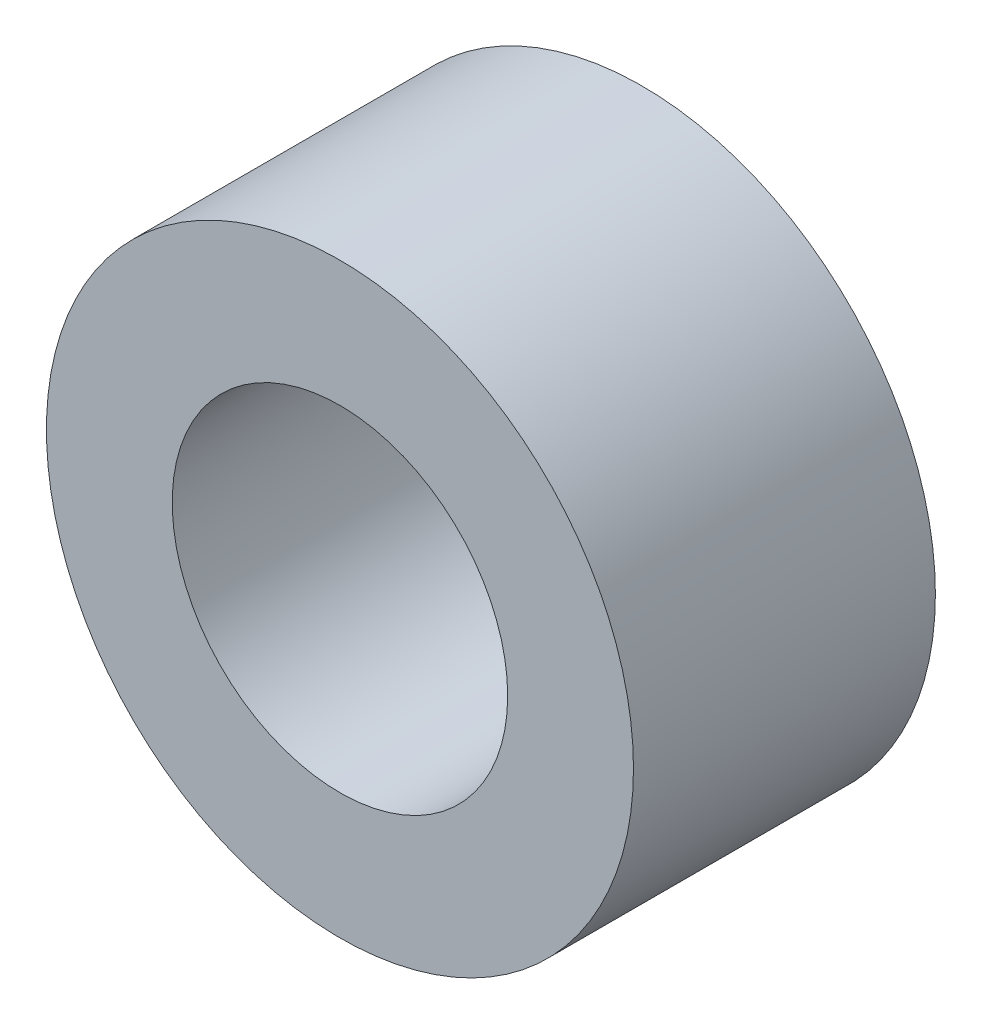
from build123d import *

# Parameters (mm, degrees)
ESQUISSE1_R        = 1.75
ESQUISSE1_R_2      = 1
BOSS_EXTRU_1_DEPTH = 1.8


with BuildPart() as part:
    # Esquisse1 → Boss.-Extru.1 (new body)
    with BuildSketch(Plane.XY):
        Circle(ESQUISSE1_R)
        Circle(ESQUISSE1_R_2, mode=Mode.SUBTRACT)
    extrude(amount=BOSS_EXTRU_1_DEPTH)


solid = part.part
